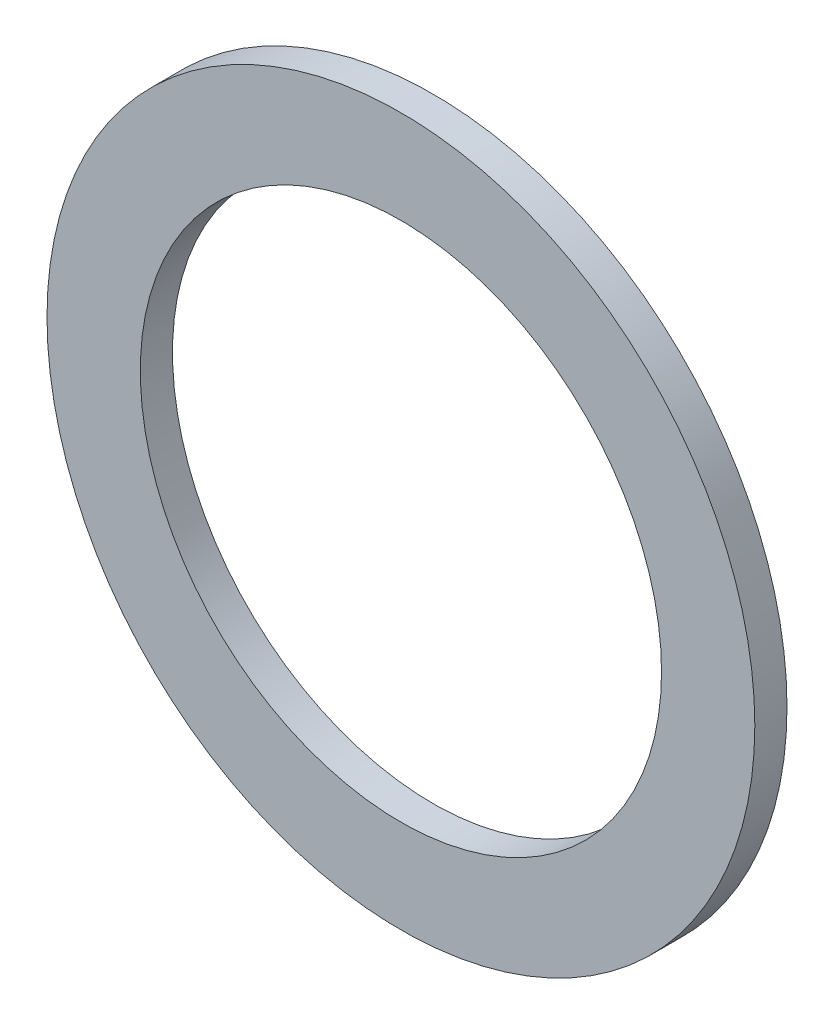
ISO-10303-21;
HEADER;
FILE_DESCRIPTION(('STEP AP214'),'2;1');
FILE_NAME('part.step','',(''),(''),'','','');
FILE_SCHEMA(('AUTOMOTIVE_DESIGN { 1 0 10303 214 1 1 1 1 }'));
ENDSEC;
DATA;
#1=APPLICATION_CONTEXT('core data for automotive mechanical design processes');
#2=APPLICATION_PROTOCOL_DEFINITION('international standard','automotive_design',2000,#1);
#3=PRODUCT_CONTEXT('',#1,'mechanical');
#4=PRODUCT('Part','Part','',(#3));
#5=PRODUCT_RELATED_PRODUCT_CATEGORY('part','',(#4));
#6=PRODUCT_DEFINITION_FORMATION('','',#4);
#7=PRODUCT_DEFINITION_CONTEXT('part definition',#1,'design');
#8=PRODUCT_DEFINITION('design','',#6,#7);
#9=PRODUCT_DEFINITION_SHAPE('','',#8);
#10=(LENGTH_UNIT() NAMED_UNIT(*) SI_UNIT(.MILLI.,.METRE.));
#11=(NAMED_UNIT(*) PLANE_ANGLE_UNIT() SI_UNIT($,.RADIAN.));
#12=(NAMED_UNIT(*) SI_UNIT($,.STERADIAN.) SOLID_ANGLE_UNIT());
#13=UNCERTAINTY_MEASURE_WITH_UNIT(LENGTH_MEASURE(1.E-05),#10,'distance_accuracy_value','');
#14=(GEOMETRIC_REPRESENTATION_CONTEXT(3) GLOBAL_UNCERTAINTY_ASSIGNED_CONTEXT((#13)) GLOBAL_UNIT_ASSIGNED_CONTEXT((#10,
#11,#12)) REPRESENTATION_CONTEXT('',''));
#15=CARTESIAN_POINT('',(0.,0.,0.));
#16=DIRECTION('',(0.,0.,1.));
#17=DIRECTION('',(1.,0.,0.));
#18=AXIS2_PLACEMENT_3D('',#15,#16,#17);
#19=CARTESIAN_POINT('',(0.,0.,5.));
#20=DIRECTION('',(0.,0.,1.));
#21=DIRECTION('',(1.,0.,0.));
#22=AXIS2_PLACEMENT_3D('',#19,#20,#21);
#23=PLANE('',#22);
#24=CARTESIAN_POINT('',(0.,0.,5.));
#25=DIRECTION('',(0.,0.,1.));
#26=DIRECTION('',(1.,0.,0.));
#27=AXIS2_PLACEMENT_3D('',#24,#25,#26);
#28=CIRCLE('',#27,55.);
#29=CARTESIAN_POINT('',(55.,0.,5.));
#30=VERTEX_POINT('',#29);
#31=EDGE_CURVE('E10',#30,#30,#28,.T.);
#32=ORIENTED_EDGE('',*,*,#31,.T.);
#33=EDGE_LOOP('',(#32));
#34=FACE_BOUND('',#33,.T.);
#35=CARTESIAN_POINT('',(0.,0.,5.));
#36=DIRECTION('',(0.,0.,1.));
#37=DIRECTION('',(1.,0.,0.));
#38=AXIS2_PLACEMENT_3D('',#35,#36,#37);
#39=CIRCLE('',#38,40.5);
#40=CARTESIAN_POINT('',(40.5,0.,5.));
#41=VERTEX_POINT('',#40);
#42=EDGE_CURVE('E41',#41,#41,#39,.T.);
#43=ORIENTED_EDGE('',*,*,#42,.F.);
#44=EDGE_LOOP('',(#43));
#45=FACE_BOUND('',#44,.T.);
#46=ADVANCED_FACE('F30',(#34,#45),#23,.T.);
#47=CARTESIAN_POINT('',(0.,0.,0.));
#48=DIRECTION('',(0.,0.,1.));
#49=DIRECTION('',(1.,0.,0.));
#50=AXIS2_PLACEMENT_3D('',#47,#48,#49);
#51=PLANE('',#50);
#52=CARTESIAN_POINT('',(0.,0.,0.));
#53=DIRECTION('',(0.,0.,1.));
#54=DIRECTION('',(1.,0.,0.));
#55=AXIS2_PLACEMENT_3D('',#52,#53,#54);
#56=CIRCLE('',#55,55.);
#57=CARTESIAN_POINT('',(55.,0.,0.));
#58=VERTEX_POINT('',#57);
#59=EDGE_CURVE('E37',#58,#58,#56,.T.);
#60=ORIENTED_EDGE('',*,*,#59,.F.);
#61=EDGE_LOOP('',(#60));
#62=FACE_BOUND('',#61,.T.);
#63=CARTESIAN_POINT('',(0.,0.,0.));
#64=DIRECTION('',(0.,0.,1.));
#65=DIRECTION('',(1.,0.,0.));
#66=AXIS2_PLACEMENT_3D('',#63,#64,#65);
#67=CIRCLE('',#66,40.5);
#68=CARTESIAN_POINT('',(40.5,0.,0.));
#69=VERTEX_POINT('',#68);
#70=EDGE_CURVE('E45',#69,#69,#67,.T.);
#71=ORIENTED_EDGE('',*,*,#70,.T.);
#72=EDGE_LOOP('',(#71));
#73=FACE_BOUND('',#72,.T.);
#74=ADVANCED_FACE('F51',(#62,#73),#51,.F.);
#75=CARTESIAN_POINT('',(0.,0.,5.));
#76=DIRECTION('',(0.,0.,-1.));
#77=DIRECTION('',(-1.,0.,0.));
#78=AXIS2_PLACEMENT_3D('',#75,#76,#77);
#79=CYLINDRICAL_SURFACE('',#78,55.);
#80=ORIENTED_EDGE('',*,*,#31,.F.);
#81=EDGE_LOOP('',(#80));
#82=FACE_BOUND('',#81,.T.);
#83=ORIENTED_EDGE('',*,*,#59,.T.);
#84=EDGE_LOOP('',(#83));
#85=FACE_BOUND('',#84,.T.);
#86=ADVANCED_FACE('F32',(#82,#85),#79,.T.);
#87=CARTESIAN_POINT('',(0.,0.,5.));
#88=DIRECTION('',(0.,0.,-1.));
#89=DIRECTION('',(-1.,0.,0.));
#90=AXIS2_PLACEMENT_3D('',#87,#88,#89);
#91=CYLINDRICAL_SURFACE('',#90,40.5);
#92=ORIENTED_EDGE('',*,*,#42,.T.);
#93=EDGE_LOOP('',(#92));
#94=FACE_BOUND('',#93,.T.);
#95=ORIENTED_EDGE('',*,*,#70,.F.);
#96=EDGE_LOOP('',(#95));
#97=FACE_BOUND('',#96,.T.);
#98=ADVANCED_FACE('F53',(#94,#97),#91,.F.);
#99=CLOSED_SHELL('',(#46,#74,#86,#98));
#100=MANIFOLD_SOLID_BREP('B2',#99);
#101=ADVANCED_BREP_SHAPE_REPRESENTATION('',(#18,#100),#14);
#102=SHAPE_DEFINITION_REPRESENTATION(#9,#101);
ENDSEC;
END-ISO-10303-21;
